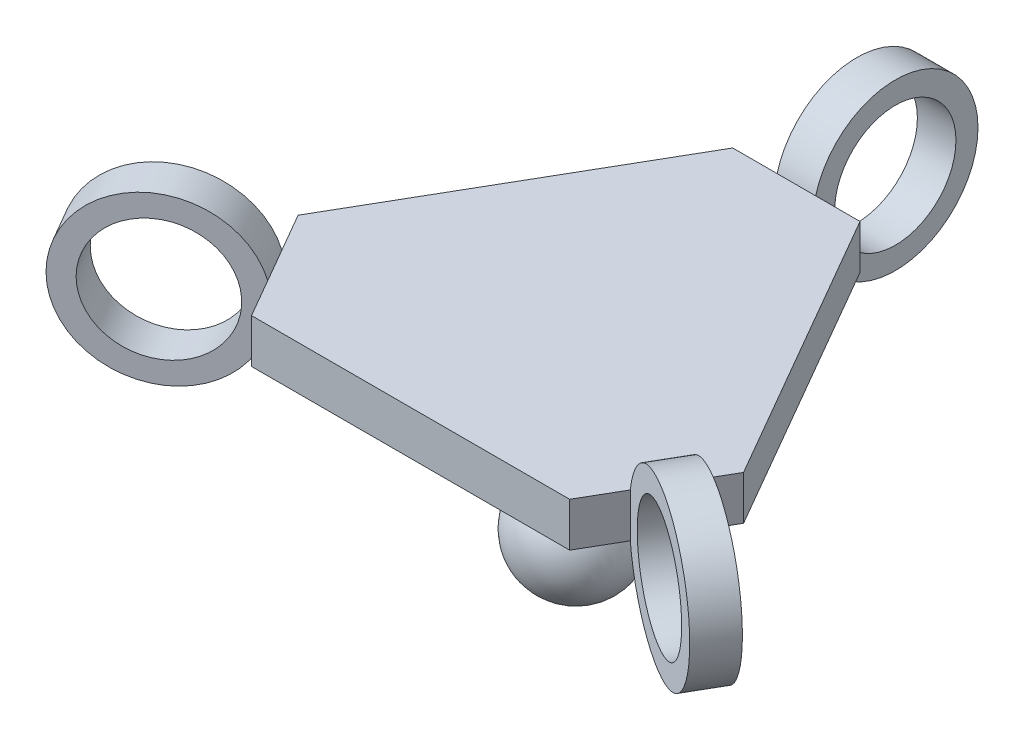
from build123d import *

# Parameters (mm, degrees)
BOSS_EXTRUDE1_DEPTH      = 8
SKETCH2_R                = 5
CUT_EXTRUDE1_DEPTH       = 107
BOSS_EXTRUDE2_DEPTH      = 3.5
BOSS_EXTRUDE2_DEPTH_BACK = 3.5
SKETCH3_R                = 15
SKETCH4_R                = 11
CUT_EXTRUDE2_DEPTH       = 19.5
CIRPATTERN1_COUNT        = 3
SKETCH6_R                = 5
BOSS_EXTRUDE3_DEPTH      = 34


with BuildPart() as part:
    # Sketch1 → Boss-Extrude1 (new body)
    with BuildSketch(Plane(origin=(0, 0, 0), x_dir=(1, 0, 0), z_dir=(0, 1, 0))):
        Polygon((-11.547005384, 40), (-40.414518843, -10), (-28.867513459, -30), (28.867513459, -30), (40.414518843, -10), (11.547005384, 40), align=None)
    extrude(amount=BOSS_EXTRUDE1_DEPTH)

    # Sketch2 → Cut-Extrude1 (cut)
    with BuildSketch(Plane(origin=(0, 8, 0), x_dir=(1, 0, 0), z_dir=(0, 1, 0))):
        with Locations(Location((0, 0, 0), (0, 0, 270))):
            Circle(SKETCH2_R)
    extrude(amount=-CUT_EXTRUDE1_DEPTH, mode=Mode.SUBTRACT)

    # Sketch3 → Boss-Extrude2 (add, two sides: drawn at the far end of the back side and taken through both)
    with BuildSketch(Plane(origin=(0, 0, 0), x_dir=(0, 0, -1), z_dir=(1, 0, 0)).offset(-BOSS_EXTRUDE2_DEPTH_BACK)):
        with Locations((54.454926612, 4.00688116)):
            Circle(SKETCH3_R)
    extrude(amount=BOSS_EXTRUDE2_DEPTH + BOSS_EXTRUDE2_DEPTH_BACK)

    # Sketch4 → Cut-Extrude2 (cut)
    with BuildSketch(Plane(origin=(3.5, 0, 0), x_dir=(0, 0, -1), z_dir=(1, 0, 0))):
        with Locations((54.454926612, 4.00688116)):
            Circle(SKETCH4_R)
    extrude(amount=-CUT_EXTRUDE2_DEPTH, mode=Mode.SUBTRACT)


with BuildPart() as cirpattern1_1:
    # CirPattern1: pattern copy
    add(part.part.rotate(Axis((0, 0, 0), (0, 1, 0)), 1 * 360 / CIRPATTERN1_COUNT))


with BuildPart() as cirpattern1_2:
    # CirPattern1: pattern copy
    add(part.part.rotate(Axis((0, 0, 0), (0, 1, 0)), 2 * 360 / CIRPATTERN1_COUNT))


with BuildPart() as part_1:
    add(part.part)

    add(cirpattern1_1.part)  # Boss-Extrude3 merges CirPattern1_1

    add(cirpattern1_2.part)  # Boss-Extrude3 merges CirPattern1_2
    # Sketch6 → Boss-Extrude3 (add)
    with BuildSketch(Plane(origin=(0, 8, 0), x_dir=(1, 0, 0), z_dir=(0, 1, 0))):
        with Locations(Location((0, 0, 0), (0, 0, 270))):
            Circle(SKETCH6_R)
    extrude(amount=-BOSS_EXTRUDE3_DEPTH)


with BuildPart() as body_2:
    # Sketch8 → Revolve1 (revolve)
    with BuildSketch(Plane(origin=(0, -26, 0), x_dir=(-1, 0, 0), z_dir=(0, -1, 0))):
        with BuildLine():
            Line((0, 10), (0, -10))
            ThreePointArc((0, -10), (10, 0), (0, 10))
        make_face()
    revolve(axis=Axis((0, -26, 0), (0, 0, -1)))


solid = Compound([part_1.part, body_2.part])
